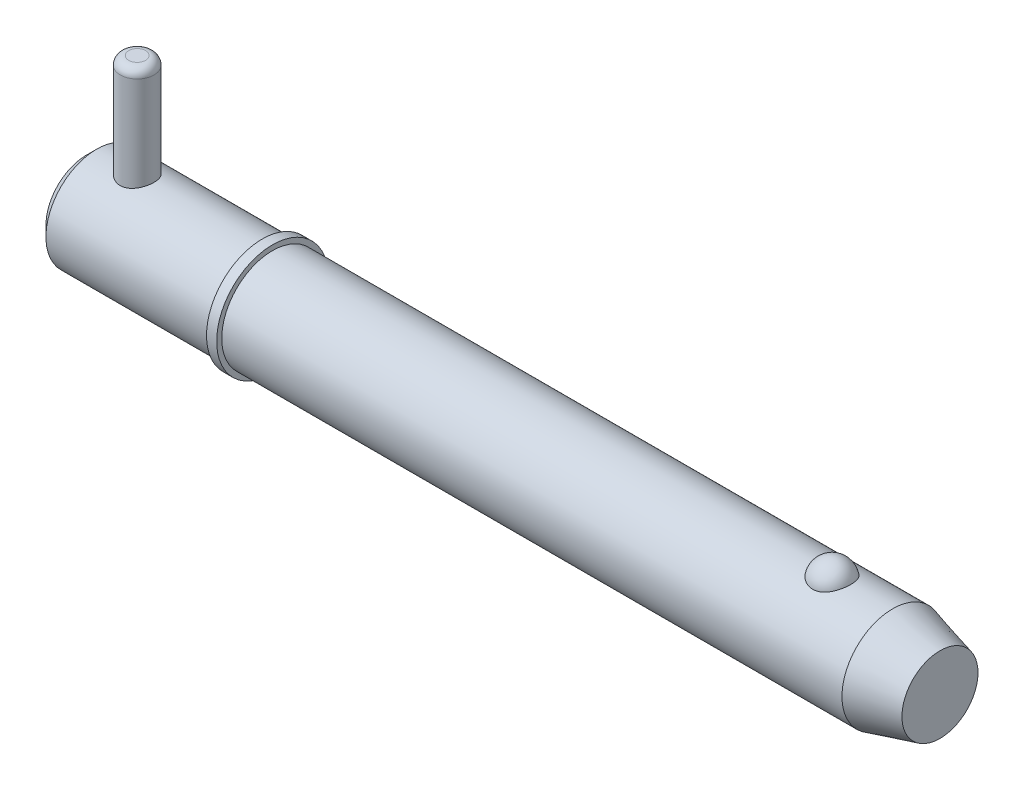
ISO-10303-21;
HEADER;
FILE_DESCRIPTION(('STEP AP214'),'2;1');
FILE_NAME('part.step','',(''),(''),'','','');
FILE_SCHEMA(('AUTOMOTIVE_DESIGN { 1 0 10303 214 1 1 1 1 }'));
ENDSEC;
DATA;
#1=APPLICATION_CONTEXT('core data for automotive mechanical design processes');
#2=APPLICATION_PROTOCOL_DEFINITION('international standard','automotive_design',2000,#1);
#3=PRODUCT_CONTEXT('',#1,'mechanical');
#4=PRODUCT('Part','Part','',(#3));
#5=PRODUCT_RELATED_PRODUCT_CATEGORY('part','',(#4));
#6=PRODUCT_DEFINITION_FORMATION('','',#4);
#7=PRODUCT_DEFINITION_CONTEXT('part definition',#1,'design');
#8=PRODUCT_DEFINITION('design','',#6,#7);
#9=PRODUCT_DEFINITION_SHAPE('','',#8);
#10=(LENGTH_UNIT() NAMED_UNIT(*) SI_UNIT(.MILLI.,.METRE.));
#11=(NAMED_UNIT(*) PLANE_ANGLE_UNIT() SI_UNIT($,.RADIAN.));
#12=(NAMED_UNIT(*) SI_UNIT($,.STERADIAN.) SOLID_ANGLE_UNIT());
#13=UNCERTAINTY_MEASURE_WITH_UNIT(LENGTH_MEASURE(1.E-05),#10,'distance_accuracy_value','');
#14=(GEOMETRIC_REPRESENTATION_CONTEXT(3) GLOBAL_UNCERTAINTY_ASSIGNED_CONTEXT((#13)) GLOBAL_UNIT_ASSIGNED_CONTEXT((#10,
#11,#12)) REPRESENTATION_CONTEXT('',''));
#15=CARTESIAN_POINT('',(0.,0.,0.));
#16=DIRECTION('',(0.,0.,1.));
#17=DIRECTION('',(1.,0.,0.));
#18=AXIS2_PLACEMENT_3D('',#15,#16,#17);
#19=CARTESIAN_POINT('',(9.525,28.575,0.));
#20=DIRECTION('',(0.,-1.,0.));
#21=DIRECTION('',(0.,0.,-1.));
#22=AXIS2_PLACEMENT_3D('',#19,#20,#21);
#23=CYLINDRICAL_SURFACE('',#22,3.175);
#24=CARTESIAN_POINT('',(9.525,-7.93750000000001,0.));
#25=DIRECTION('',(0.,1.,0.));
#26=DIRECTION('',(0.,0.,1.));
#27=AXIS2_PLACEMENT_3D('',#24,#25,#26);
#28=CIRCLE('',#27,3.175);
#29=CARTESIAN_POINT('',(9.525,-7.93750000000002,-3.175));
#30=VERTEX_POINT('',#29);
#31=EDGE_CURVE('P0_E25',#30,#30,#28,.T.);
#32=CARTESIAN_POINT('',(9.525,26.9875,0.));
#33=DIRECTION('',(0.,1.,0.));
#34=DIRECTION('',(0.,0.,1.));
#35=AXIS2_PLACEMENT_3D('',#32,#33,#34);
#36=CIRCLE('',#35,3.175);
#37=CARTESIAN_POINT('',(9.525,26.9875,-3.175));
#38=VERTEX_POINT('',#37);
#39=EDGE_CURVE('P0_E29',#38,#38,#36,.F.);
#40=CARTESIAN_POINT('',(9.525,-7.93750000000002,-3.175));
#41=CARTESIAN_POINT('',(9.525,-7.57369791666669,-3.175));
#42=CARTESIAN_POINT('',(9.525,-7.20989583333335,-3.175));
#43=CARTESIAN_POINT('',(9.525,-6.48229166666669,-3.175));
#44=CARTESIAN_POINT('',(9.525,-6.11848958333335,-3.175));
#45=CARTESIAN_POINT('',(9.525,-5.39088541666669,-3.175));
#46=CARTESIAN_POINT('',(9.525,-5.02708333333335,-3.175));
#47=CARTESIAN_POINT('',(9.525,-4.29947916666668,-3.175));
#48=CARTESIAN_POINT('',(9.525,-3.93567708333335,-3.175));
#49=CARTESIAN_POINT('',(9.525,-3.20807291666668,-3.175));
#50=CARTESIAN_POINT('',(9.525,-2.84427083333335,-3.175));
#51=CARTESIAN_POINT('',(9.525,-2.11666666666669,-3.175));
#52=CARTESIAN_POINT('',(9.525,-1.75286458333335,-3.175));
#53=CARTESIAN_POINT('',(9.525,-1.02526041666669,-3.175));
#54=CARTESIAN_POINT('',(9.525,-0.661458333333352,-3.175));
#55=CARTESIAN_POINT('',(9.525,0.0661458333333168,-3.175));
#56=CARTESIAN_POINT('',(9.525,0.429947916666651,-3.175));
#57=CARTESIAN_POINT('',(9.525,1.15755208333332,-3.175));
#58=CARTESIAN_POINT('',(9.525,1.52135416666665,-3.175));
#59=CARTESIAN_POINT('',(9.525,2.24895833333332,-3.175));
#60=CARTESIAN_POINT('',(9.525,2.61276041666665,-3.175));
#61=CARTESIAN_POINT('',(9.525,3.34036458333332,-3.175));
#62=CARTESIAN_POINT('',(9.525,3.70416666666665,-3.175));
#63=CARTESIAN_POINT('',(9.525,4.43177083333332,-3.175));
#64=CARTESIAN_POINT('',(9.525,4.79557291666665,-3.175));
#65=CARTESIAN_POINT('',(9.525,5.52317708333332,-3.175));
#66=CARTESIAN_POINT('',(9.525,5.88697916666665,-3.175));
#67=CARTESIAN_POINT('',(9.525,6.61458333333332,-3.175));
#68=CARTESIAN_POINT('',(9.525,6.97838541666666,-3.175));
#69=CARTESIAN_POINT('',(9.525,7.70598958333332,-3.175));
#70=CARTESIAN_POINT('',(9.525,8.06979166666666,-3.175));
#71=CARTESIAN_POINT('',(9.525,8.79739583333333,-3.175));
#72=CARTESIAN_POINT('',(9.525,9.16119791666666,-3.175));
#73=CARTESIAN_POINT('',(9.525,9.88880208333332,-3.175));
#74=CARTESIAN_POINT('',(9.525,10.2526041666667,-3.175));
#75=CARTESIAN_POINT('',(9.525,10.9802083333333,-3.175));
#76=CARTESIAN_POINT('',(9.525,11.3440104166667,-3.175));
#77=CARTESIAN_POINT('',(9.525,12.0716145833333,-3.175));
#78=CARTESIAN_POINT('',(9.525,12.4354166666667,-3.175));
#79=CARTESIAN_POINT('',(9.525,13.1630208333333,-3.175));
#80=CARTESIAN_POINT('',(9.525,13.5268229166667,-3.175));
#81=CARTESIAN_POINT('',(9.525,14.2544270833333,-3.175));
#82=CARTESIAN_POINT('',(9.525,14.6182291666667,-3.175));
#83=CARTESIAN_POINT('',(9.525,15.3458333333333,-3.175));
#84=CARTESIAN_POINT('',(9.525,15.7096354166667,-3.175));
#85=CARTESIAN_POINT('',(9.525,16.4372395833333,-3.175));
#86=CARTESIAN_POINT('',(9.525,16.8010416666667,-3.175));
#87=CARTESIAN_POINT('',(9.525,17.5286458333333,-3.175));
#88=CARTESIAN_POINT('',(9.525,17.8924479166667,-3.175));
#89=CARTESIAN_POINT('',(9.525,18.6200520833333,-3.175));
#90=CARTESIAN_POINT('',(9.525,18.9838541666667,-3.175));
#91=CARTESIAN_POINT('',(9.525,19.7114583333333,-3.175));
#92=CARTESIAN_POINT('',(9.525,20.0752604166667,-3.175));
#93=CARTESIAN_POINT('',(9.525,20.8028645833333,-3.175));
#94=CARTESIAN_POINT('',(9.525,21.1666666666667,-3.175));
#95=CARTESIAN_POINT('',(9.525,21.8942708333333,-3.175));
#96=CARTESIAN_POINT('',(9.525,22.2580729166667,-3.175));
#97=CARTESIAN_POINT('',(9.525,22.9856770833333,-3.175));
#98=CARTESIAN_POINT('',(9.525,23.3494791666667,-3.175));
#99=CARTESIAN_POINT('',(9.525,24.0770833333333,-3.175));
#100=CARTESIAN_POINT('',(9.525,24.4408854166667,-3.175));
#101=CARTESIAN_POINT('',(9.525,25.1684895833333,-3.175));
#102=CARTESIAN_POINT('',(9.525,25.5322916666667,-3.175));
#103=CARTESIAN_POINT('',(9.525,26.2598958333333,-3.175));
#104=CARTESIAN_POINT('',(9.525,26.6236979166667,-3.175));
#105=CARTESIAN_POINT('',(9.525,26.9875,-3.175));
#106=B_SPLINE_CURVE_WITH_KNOTS('',3,(#40,#41,#42,#43,#44,#45,#46,#47,#48,#49,#50,#51,#52,#53,
#54,#55,#56,#57,#58,#59,#60,#61,#62,#63,#64,#65,#66,#67,#68,#69,#70,#71,#72,#73,#74,#75,#76,#77,
#78,#79,#80,#81,#82,#83,#84,#85,#86,#87,#88,#89,#90,#91,#92,#93,#94,#95,#96,#97,#98,#99,#100,
#101,#102,#103,#104,#105),.UNSPECIFIED.,.F.,.F.,(4,2,2,2,2,2,2,2,2,2,2,2,2,2,2,2,2,2,2,2,2,2,2,
2,2,2,2,2,2,2,2,2,4),(0.,1.09140625,2.1828125,3.27421875,4.365625,5.45703125,6.5484375,
7.63984375,8.73125000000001,9.82265625,10.9140625,12.00546875,13.096875,14.18828125,15.2796875,
16.37109375,17.4625,18.55390625,19.6453125,20.73671875,21.828125,22.91953125,24.0109375,
25.10234375,26.19375,27.28515625,28.3765625,29.46796875,30.559375,31.65078125,32.7421875,
33.83359375,34.925),.UNSPECIFIED.);
#107=EDGE_CURVE('P0_BSEAM14',#30,#38,#106,.T.);
#108=ORIENTED_EDGE('',*,*,#31,.T.);
#109=ORIENTED_EDGE('',*,*,#39,.T.);
#110=ORIENTED_EDGE('',*,*,#107,.T.);
#111=ORIENTED_EDGE('',*,*,#107,.F.);
#112=EDGE_LOOP('',(#108,#110,#109,#111));
#113=FACE_BOUND('',#112,.T.);
#114=ADVANCED_FACE('P0_F14',(#113),#23,.T.);
#115=CARTESIAN_POINT('',(9.525,28.575,0.));
#116=DIRECTION('',(0.,1.,0.));
#117=DIRECTION('',(0.,0.,1.));
#118=AXIS2_PLACEMENT_3D('',#115,#116,#117);
#119=PLANE('',#118);
#120=CARTESIAN_POINT('',(9.525,28.575,0.));
#121=DIRECTION('',(0.,1.,0.));
#122=DIRECTION('',(0.,0.,1.));
#123=AXIS2_PLACEMENT_3D('',#120,#121,#122);
#124=CIRCLE('',#123,1.5875);
#125=CARTESIAN_POINT('',(9.525,28.575,1.5875));
#126=VERTEX_POINT('',#125);
#127=EDGE_CURVE('P0_E10',#126,#126,#124,.T.);
#128=ORIENTED_EDGE('',*,*,#127,.T.);
#129=EDGE_LOOP('',(#128));
#130=FACE_BOUND('',#129,.T.);
#131=ADVANCED_FACE('P0_F46',(#130),#119,.T.);
#132=CARTESIAN_POINT('',(9.525,-9.525,0.));
#133=DIRECTION('',(0.,1.,0.));
#134=DIRECTION('',(0.,0.,1.));
#135=AXIS2_PLACEMENT_3D('',#132,#133,#134);
#136=PLANE('',#135);
#137=CARTESIAN_POINT('',(9.525,-9.525,0.));
#138=DIRECTION('',(0.,1.,0.));
#139=DIRECTION('',(0.,0.,1.));
#140=AXIS2_PLACEMENT_3D('',#137,#138,#139);
#141=CIRCLE('',#140,1.5875);
#142=CARTESIAN_POINT('',(9.525,-9.525,1.5875));
#143=VERTEX_POINT('',#142);
#144=EDGE_CURVE('P0_E21',#143,#143,#141,.F.);
#145=ORIENTED_EDGE('',*,*,#144,.T.);
#146=EDGE_LOOP('',(#145));
#147=FACE_BOUND('',#146,.T.);
#148=ADVANCED_FACE('P0_F43',(#147),#136,.F.);
#149=CARTESIAN_POINT('',(9.525,-7.9375,0.));
#150=DIRECTION('',(0.,1.,0.));
#151=DIRECTION('',(0.,0.,1.));
#152=AXIS2_PLACEMENT_3D('',#149,#150,#151);
#153=DEGENERATE_TOROIDAL_SURFACE('',#152,1.5875,1.5875,.T.);
#154=ORIENTED_EDGE('',*,*,#144,.F.);
#155=EDGE_LOOP('',(#154));
#156=FACE_BOUND('',#155,.T.);
#157=ORIENTED_EDGE('',*,*,#31,.F.);
#158=EDGE_LOOP('',(#157));
#159=FACE_BOUND('',#158,.T.);
#160=ADVANCED_FACE('P0_F38',(#156,#159),#153,.T.);
#161=CARTESIAN_POINT('',(9.525,26.9875,0.));
#162=DIRECTION('',(0.,1.,0.));
#163=DIRECTION('',(0.,0.,1.));
#164=AXIS2_PLACEMENT_3D('',#161,#162,#163);
#165=DEGENERATE_TOROIDAL_SURFACE('',#164,1.5875,1.5875,.T.);
#166=ORIENTED_EDGE('',*,*,#39,.F.);
#167=EDGE_LOOP('',(#166));
#168=FACE_BOUND('',#167,.T.);
#169=ORIENTED_EDGE('',*,*,#127,.F.);
#170=EDGE_LOOP('',(#169));
#171=FACE_BOUND('',#170,.T.);
#172=ADVANCED_FACE('P0_F16',(#168,#171),#165,.T.);
#173=CLOSED_SHELL('',(#114,#131,#148,#160,#172));
#174=MANIFOLD_SOLID_BREP('P0_B1',#173);
#175=CARTESIAN_POINT('',(0.,0.,0.));
#176=DIRECTION('',(1.,0.,0.));
#177=DIRECTION('',(0.,0.,-1.));
#178=AXIS2_PLACEMENT_3D('',#175,#176,#177);
#179=CYLINDRICAL_SURFACE('',#178,9.525);
#180=CARTESIAN_POINT('',(151.443054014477,0.,0.));
#181=DIRECTION('',(1.,0.,0.));
#182=DIRECTION('',(0.,0.,-1.));
#183=AXIS2_PLACEMENT_3D('',#180,#181,#182);
#184=CIRCLE('',#183,9.525);
#185=CARTESIAN_POINT('',(151.443054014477,0.,-9.525));
#186=VERTEX_POINT('',#185);
#187=EDGE_CURVE('P1_E81',#186,#186,#184,.T.);
#188=ORIENTED_EDGE('',*,*,#187,.F.);
#189=EDGE_LOOP('',(#188));
#190=FACE_BOUND('',#189,.T.);
#191=CARTESIAN_POINT('',(34.93,0.,0.));
#192=DIRECTION('',(1.,0.,0.));
#193=DIRECTION('',(0.,0.,-1.));
#194=AXIS2_PLACEMENT_3D('',#191,#192,#193);
#195=CIRCLE('',#194,9.525);
#196=CARTESIAN_POINT('',(34.93,0.,-9.525));
#197=VERTEX_POINT('',#196);
#198=EDGE_CURVE('P1_E85',#197,#197,#195,.T.);
#199=ORIENTED_EDGE('',*,*,#198,.T.);
#200=EDGE_LOOP('',(#199));
#201=FACE_BOUND('',#200,.T.);
#202=CARTESIAN_POINT('',(140.045757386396,8.80405803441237,3.63513233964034));
#203=CARTESIAN_POINT('',(139.951676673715,8.80405953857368,3.63513053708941));
#204=CARTESIAN_POINT('',(139.857561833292,8.80561325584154,3.63137461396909));
#205=CARTESIAN_POINT('',(139.670012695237,8.81177748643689,3.61638665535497));
#206=CARTESIAN_POINT('',(139.576578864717,8.81638992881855,3.60514990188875));
#207=CARTESIAN_POINT('',(139.297945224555,8.83467114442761,3.56024627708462));
#208=CARTESIAN_POINT('',(139.114691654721,8.85278327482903,3.51538626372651));
#209=CARTESIAN_POINT('',(138.759509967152,8.89871214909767,3.39742145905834));
#210=CARTESIAN_POINT('',(138.587553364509,8.92650327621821,3.32439116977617));
#211=CARTESIAN_POINT('',(138.258707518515,8.98874819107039,3.15220244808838));
#212=CARTESIAN_POINT('',(138.101811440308,9.02319893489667,3.05305594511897));
#213=CARTESIAN_POINT('',(137.802214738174,9.09629186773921,2.82797815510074));
#214=CARTESIAN_POINT('',(137.660060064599,9.13502685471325,2.70135138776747));
#215=CARTESIAN_POINT('',(137.398299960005,9.21186572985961,2.42641932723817));
#216=CARTESIAN_POINT('',(137.278701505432,9.24996941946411,2.2781073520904));
#217=CARTESIAN_POINT('',(137.059645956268,9.32341082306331,1.95652290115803));
#218=CARTESIAN_POINT('',(136.961317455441,9.35855090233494,1.78243511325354));
#219=CARTESIAN_POINT('',(136.793819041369,9.42045142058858,1.41937246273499));
#220=CARTESIAN_POINT('',(136.724651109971,9.44721128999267,1.23039658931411));
#221=CARTESIAN_POINT('',(136.616199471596,9.48990641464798,0.84037088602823));
#222=CARTESIAN_POINT('',(136.577288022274,9.50570658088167,0.639202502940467));
#223=CARTESIAN_POINT('',(136.531555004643,9.52433146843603,0.232664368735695));
#224=CARTESIAN_POINT('',(136.524732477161,9.52715657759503,0.0272947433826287));
#225=CARTESIAN_POINT('',(136.543255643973,9.51956918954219,-0.380478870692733));
#226=CARTESIAN_POINT('',(136.568405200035,9.50923740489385,-0.582893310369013));
#227=CARTESIAN_POINT('',(136.65002537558,9.47651897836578,-0.98029399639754));
#228=CARTESIAN_POINT('',(136.706496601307,9.45413210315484,-1.17528009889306));
#229=CARTESIAN_POINT('',(136.849719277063,9.39954044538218,-1.55263697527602));
#230=CARTESIAN_POINT('',(136.936512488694,9.36732213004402,-1.73498993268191));
#231=CARTESIAN_POINT('',(137.138610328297,9.29640700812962,-2.08177763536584));
#232=CARTESIAN_POINT('',(137.253917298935,9.25770966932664,-2.24621090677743));
#233=CARTESIAN_POINT('',(137.511264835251,9.17775604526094,-2.5533833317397));
#234=CARTESIAN_POINT('',(137.653434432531,9.136488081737,-2.696011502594));
#235=CARTESIAN_POINT('',(137.96089985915,9.05620497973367,-2.95451229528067));
#236=CARTESIAN_POINT('',(138.126193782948,9.01718965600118,-3.07038711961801));
#237=CARTESIAN_POINT('',(138.472052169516,8.94680019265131,-3.26976836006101));
#238=CARTESIAN_POINT('',(138.652227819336,8.91528408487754,-3.35389750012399));
#239=CARTESIAN_POINT('',(139.025651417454,8.86272514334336,-3.49043503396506));
#240=CARTESIAN_POINT('',(139.218894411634,8.84167836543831,-3.54285537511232));
#241=CARTESIAN_POINT('',(139.602503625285,8.81348056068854,-3.61241306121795));
#242=CARTESIAN_POINT('',(139.792525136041,8.80568348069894,-3.6311933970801));
#243=CARTESIAN_POINT('',(140.173190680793,8.80289410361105,-3.63795342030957));
#244=CARTESIAN_POINT('',(140.363834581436,8.80789922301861,-3.62593932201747));
#245=CARTESIAN_POINT('',(140.734007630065,8.82974915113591,-3.57238430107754));
#246=CARTESIAN_POINT('',(140.913697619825,8.84621463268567,-3.53178890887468));
#247=CARTESIAN_POINT('',(141.263422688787,8.88875330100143,-3.42331083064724));
#248=CARTESIAN_POINT('',(141.433456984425,8.91482726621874,-3.35542593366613));
#249=CARTESIAN_POINT('',(141.763237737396,8.97448239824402,-3.19248225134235));
#250=CARTESIAN_POINT('',(141.922680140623,9.00821446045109,-3.0968647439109));
#251=CARTESIAN_POINT('',(142.223513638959,9.07935398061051,-2.88162736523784));
#252=CARTESIAN_POINT('',(142.364900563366,9.11676228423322,-2.76200196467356));
#253=CARTESIAN_POINT('',(142.63331931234,9.19347419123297,-2.49516285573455));
#254=CARTESIAN_POINT('',(142.759275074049,9.23277872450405,-2.34686614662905));
#255=CARTESIAN_POINT('',(142.985522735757,9.3073761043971,-2.03093683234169));
#256=CARTESIAN_POINT('',(143.08581004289,9.34266823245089,-1.86330077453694));
#257=CARTESIAN_POINT('',(143.261514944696,9.40674710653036,-1.50744893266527));
#258=CARTESIAN_POINT('',(143.336041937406,9.43529176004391,-1.31874876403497));
#259=CARTESIAN_POINT('',(143.45416505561,9.48144132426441,-0.930631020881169));
#260=CARTESIAN_POINT('',(143.497760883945,9.49904612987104,-0.731213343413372));
#261=CARTESIAN_POINT('',(143.553158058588,9.5215314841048,-0.327147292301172));
#262=CARTESIAN_POINT('',(143.564935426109,9.52640243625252,-0.122495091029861));
#263=CARTESIAN_POINT('',(143.556382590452,9.5228957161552,0.28601848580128));
#264=CARTESIAN_POINT('',(143.53605305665,9.5145183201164,0.489879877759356));
#265=CARTESIAN_POINT('',(143.463884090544,9.48544083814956,0.88999431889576));
#266=CARTESIAN_POINT('',(143.412199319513,9.46480124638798,1.08627971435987));
#267=CARTESIAN_POINT('',(143.278491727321,9.4133389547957,1.46682086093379));
#268=CARTESIAN_POINT('',(143.196466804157,9.38251554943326,1.65107577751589));
#269=CARTESIAN_POINT('',(143.00319292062,9.31365636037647,2.00346348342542));
#270=CARTESIAN_POINT('',(142.891783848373,9.27558138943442,2.17150083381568));
#271=CARTESIAN_POINT('',(142.642294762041,9.19638714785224,2.48563115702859));
#272=CARTESIAN_POINT('',(142.504216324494,9.15526805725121,2.63172542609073));
#273=CARTESIAN_POINT('',(142.204843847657,9.07465393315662,2.89750997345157));
#274=CARTESIAN_POINT('',(142.043610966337,9.03515496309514,3.01726776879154));
#275=CARTESIAN_POINT('',(141.701613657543,8.96227564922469,3.22732920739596));
#276=CARTESIAN_POINT('',(141.520841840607,8.92889763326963,3.31762165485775));
#277=CARTESIAN_POINT('',(141.151445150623,8.8734538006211,3.46314419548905));
#278=CARTESIAN_POINT('',(140.96332371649,8.85102983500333,3.51950082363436));
#279=CARTESIAN_POINT('',(140.67578699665,8.8266696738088,3.57993683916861));
#280=CARTESIAN_POINT('',(140.579133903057,8.82009725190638,3.5960621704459));
#281=CARTESIAN_POINT('',(140.384677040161,8.81020897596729,3.62022512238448));
#282=CARTESIAN_POINT('',(140.286874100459,8.80689090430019,3.62826825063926));
#283=CARTESIAN_POINT('',(140.141224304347,8.80445615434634,3.63416760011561));
#284=CARTESIAN_POINT('',(140.093495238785,8.80405727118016,3.63513325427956));
#285=CARTESIAN_POINT('',(140.045757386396,8.80405803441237,3.63513233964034));
#286=B_SPLINE_CURVE_WITH_KNOTS('',3,(#202,#203,#204,#205,#206,#207,#208,#209,#210,#211,#212,
#213,#214,#215,#216,#217,#218,#219,#220,#221,#222,#223,#224,#225,#226,#227,#228,#229,#230,#231,
#232,#233,#234,#235,#236,#237,#238,#239,#240,#241,#242,#243,#244,#245,#246,#247,#248,#249,#250,
#251,#252,#253,#254,#255,#256,#257,#258,#259,#260,#261,#262,#263,#264,#265,#266,#267,#268,#269,
#270,#271,#272,#273,#274,#275,#276,#277,#278,#279,#280,#281,#282,#283,#284,#285),.UNSPECIFIED.,
.T.,.F.,(4,2,2,2,2,2,2,2,2,2,2,2,2,2,2,2,2,2,2,2,2,2,2,2,2,2,2,2,2,2,2,2,2,2,2,2,2,2,2,2,2,4),
(0.,0.282202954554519,0.564584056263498,1.13017050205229,1.69427128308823,2.25811483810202,
2.83836627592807,3.41879688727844,4.02497117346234,4.63118665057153,5.24474754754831,
5.85829010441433,6.46808687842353,7.07789545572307,7.68854723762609,8.299249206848,
8.91296283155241,9.52662591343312,10.1275338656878,10.7282152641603,11.2986646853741,
11.8689989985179,12.4213015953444,12.973648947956,13.5380053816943,14.1024919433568,
14.695298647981,15.2882113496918,15.8999469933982,16.5116885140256,17.1238909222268,
17.7360805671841,18.3452748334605,18.9545113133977,19.567138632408,20.179729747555,
20.7907316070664,21.4019653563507,21.9915938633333,22.2859053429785,22.5800161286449,
22.7232098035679),.UNSPECIFIED.);
#287=CARTESIAN_POINT('',(140.045757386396,8.80405803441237,3.63513233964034));
#288=VERTEX_POINT('',#287);
#289=EDGE_CURVE('P1_E35',#288,#288,#286,.T.);
#290=ORIENTED_EDGE('',*,*,#289,.T.);
#291=EDGE_LOOP('',(#290));
#292=FACE_BOUND('',#291,.T.);
#293=ADVANCED_FACE('P1_F13',(#190,#201,#292),#179,.T.);
#294=CARTESIAN_POINT('',(0.,0.,0.));
#295=DIRECTION('',(-1.,0.,0.));
#296=DIRECTION('',(0.,0.,1.));
#297=AXIS2_PLACEMENT_3D('',#294,#295,#296);
#298=PLANE('',#297);
#299=CARTESIAN_POINT('',(0.,0.,0.));
#300=DIRECTION('',(1.,0.,0.));
#301=DIRECTION('',(0.,0.,-1.));
#302=AXIS2_PLACEMENT_3D('',#299,#300,#301);
#303=CIRCLE('',#302,7.62);
#304=CARTESIAN_POINT('',(0.,0.,-7.62));
#305=VERTEX_POINT('',#304);
#306=EDGE_CURVE('P1_E9',#305,#305,#303,.T.);
#307=ORIENTED_EDGE('',*,*,#306,.F.);
#308=EDGE_LOOP('',(#307));
#309=FACE_BOUND('',#308,.T.);
#310=ADVANCED_FACE('P1_F15',(#309),#298,.T.);
#311=CARTESIAN_POINT('',(1.90499999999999,0.,0.));
#312=DIRECTION('',(1.,0.,0.));
#313=DIRECTION('',(0.,0.,-1.));
#314=AXIS2_PLACEMENT_3D('',#311,#312,#313);
#315=CONICAL_SURFACE('',#314,9.525,0.785398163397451);
#316=ORIENTED_EDGE('',*,*,#306,.T.);
#317=EDGE_LOOP('',(#316));
#318=FACE_BOUND('',#317,.T.);
#319=CARTESIAN_POINT('',(1.90499999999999,0.,0.));
#320=DIRECTION('',(1.,0.,0.));
#321=DIRECTION('',(0.,0.,-1.));
#322=AXIS2_PLACEMENT_3D('',#319,#320,#321);
#323=CIRCLE('',#322,9.525);
#324=CARTESIAN_POINT('',(1.90499999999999,0.,-9.525));
#325=VERTEX_POINT('',#324);
#326=EDGE_CURVE('P1_E26',#325,#325,#323,.T.);
#327=ORIENTED_EDGE('',*,*,#326,.F.);
#328=EDGE_LOOP('',(#327));
#329=FACE_BOUND('',#328,.T.);
#330=ADVANCED_FACE('P1_F77',(#318,#329),#315,.T.);
#331=CARTESIAN_POINT('',(0.,0.,0.));
#332=DIRECTION('',(1.,0.,0.));
#333=DIRECTION('',(0.,0.,-1.));
#334=AXIS2_PLACEMENT_3D('',#331,#332,#333);
#335=CYLINDRICAL_SURFACE('',#334,9.525);
#336=CARTESIAN_POINT('',(9.525,-8.98025612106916,3.175));
#337=CARTESIAN_POINT('',(9.35206354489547,-8.98025555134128,3.17500081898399));
#338=CARTESIAN_POINT('',(9.17913201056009,-8.98530617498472,3.16082293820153));
#339=CARTESIAN_POINT('',(8.83839221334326,-9.00485797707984,3.10467734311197));
#340=CARTESIAN_POINT('',(8.67058479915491,-9.0193607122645,3.06270505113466));
#341=CARTESIAN_POINT('',(8.34508461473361,-9.05599546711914,2.95260866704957));
#342=CARTESIAN_POINT('',(8.18737272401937,-9.07811252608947,2.88453582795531));
#343=CARTESIAN_POINT('',(7.88555684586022,-9.12746212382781,2.72434567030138));
#344=CARTESIAN_POINT('',(7.74145587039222,-9.1546957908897,2.63222304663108));
#345=CARTESIAN_POINT('',(7.46531411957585,-9.21240503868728,2.42268738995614));
#346=CARTESIAN_POINT('',(7.33388351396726,-9.24296141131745,2.30449228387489));
#347=CARTESIAN_POINT('',(7.09229340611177,-9.30319020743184,2.0478358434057));
#348=CARTESIAN_POINT('',(6.98213731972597,-9.33286248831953,1.90937126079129));
#349=CARTESIAN_POINT('',(6.78345450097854,-9.38891527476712,1.61164431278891));
#350=CARTESIAN_POINT('',(6.69556709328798,-9.41518969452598,1.45193356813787));
#351=CARTESIAN_POINT('',(6.54814671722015,-9.46053437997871,1.11896913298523));
#352=CARTESIAN_POINT('',(6.48860610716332,-9.47960658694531,0.945719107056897));
#353=CARTESIAN_POINT('',(6.40163866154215,-9.50782564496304,0.596991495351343));
#354=CARTESIAN_POINT('',(6.373166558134,-9.5172947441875,0.421801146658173));
#355=CARTESIAN_POINT('',(6.3458207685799,-9.52638456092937,0.068890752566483));
#356=CARTESIAN_POINT('',(6.34693945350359,-9.52600781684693,-0.108828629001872));
#357=CARTESIAN_POINT('',(6.37808050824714,-9.51566675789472,-0.454353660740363));
#358=CARTESIAN_POINT('',(6.4069675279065,-9.50607905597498,-0.622274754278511));
#359=CARTESIAN_POINT('',(6.490947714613,-9.47886621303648,-0.950732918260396));
#360=CARTESIAN_POINT('',(6.54604265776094,-9.46124052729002,-1.11126948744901));
#361=CARTESIAN_POINT('',(6.68153768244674,-9.41945253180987,-1.42288410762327));
#362=CARTESIAN_POINT('',(6.76226085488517,-9.3952073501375,-1.57381010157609));
#363=CARTESIAN_POINT('',(6.94645456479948,-9.34270397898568,-1.86030973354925));
#364=CARTESIAN_POINT('',(7.04993142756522,-9.31444467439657,-1.99587908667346));
#365=CARTESIAN_POINT('',(7.28241619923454,-9.25532159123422,-2.2545702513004));
#366=CARTESIAN_POINT('',(7.4123967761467,-9.22439783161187,-2.37680549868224));
#367=CARTESIAN_POINT('',(7.69127470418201,-9.1645528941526,-2.5980302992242));
#368=CARTESIAN_POINT('',(7.84017496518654,-9.13563202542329,-2.6970162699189));
#369=CARTESIAN_POINT('',(8.15547526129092,-9.08273917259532,-2.87016016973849));
#370=CARTESIAN_POINT('',(8.32209451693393,-9.05884361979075,-2.94394402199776));
#371=CARTESIAN_POINT('',(8.66638917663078,-9.01959241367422,-3.06210713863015));
#372=CARTESIAN_POINT('',(8.84405991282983,-9.00423318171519,-3.10649872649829));
#373=CARTESIAN_POINT('',(9.19682677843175,-8.98460345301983,-3.16281207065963));
#374=CARTESIAN_POINT('',(9.37167742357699,-8.9798639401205,-3.17610837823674));
#375=CARTESIAN_POINT('',(9.72113927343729,-8.9806993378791,-3.17374726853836));
#376=CARTESIAN_POINT('',(9.89575051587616,-8.98627237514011,-3.15809511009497));
#377=CARTESIAN_POINT('',(10.2335233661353,-9.00663737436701,-3.09951644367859));
#378=CARTESIAN_POINT('',(10.3968722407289,-9.02110608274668,-3.05754530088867));
#379=CARTESIAN_POINT('',(10.7141759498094,-9.05727657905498,-2.94866651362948));
#380=CARTESIAN_POINT('',(10.8681291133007,-9.07897964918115,-2.88175444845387));
#381=CARTESIAN_POINT('',(11.1676828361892,-9.12802586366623,-2.72248103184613));
#382=CARTESIAN_POINT('',(11.3128635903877,-9.1555260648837,-2.62937980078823));
#383=CARTESIAN_POINT('',(11.5860387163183,-9.21276315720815,-2.42120937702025));
#384=CARTESIAN_POINT('',(11.7140280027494,-9.24250070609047,-2.30613370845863));
#385=CARTESIAN_POINT('',(11.9555513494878,-9.30259247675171,-2.05070616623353));
#386=CARTESIAN_POINT('',(12.0680936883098,-9.33290753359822,-1.90940458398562));
#387=CARTESIAN_POINT('',(12.267933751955,-9.3893275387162,-1.60917665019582));
#388=CARTESIAN_POINT('',(12.3552323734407,-9.41543263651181,-1.45025092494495));
#389=CARTESIAN_POINT('',(12.5013088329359,-9.46036988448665,-1.12007606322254));
#390=CARTESIAN_POINT('',(12.5602723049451,-9.47924920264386,-0.9489158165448));
#391=CARTESIAN_POINT('',(12.6483355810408,-9.50781089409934,-0.598355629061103));
#392=CARTESIAN_POINT('',(12.6774461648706,-9.5174965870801,-0.4189586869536));
#393=CARTESIAN_POINT('',(12.7040070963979,-9.52632915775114,-0.066088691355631));
#394=CARTESIAN_POINT('',(12.7028811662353,-9.52594996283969,0.107266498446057));
#395=CARTESIAN_POINT('',(12.6725130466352,-9.51586223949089,0.451202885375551));
#396=CARTESIAN_POINT('',(12.643273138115,-9.50615446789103,0.621784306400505));
#397=CARTESIAN_POINT('',(12.5584514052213,-9.47867404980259,0.952633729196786));
#398=CARTESIAN_POINT('',(12.5032953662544,-9.46103195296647,1.1130225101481));
#399=CARTESIAN_POINT('',(12.3686013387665,-9.41949985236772,1.42233126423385));
#400=CARTESIAN_POINT('',(12.2890589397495,-9.39560871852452,1.57124915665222));
#401=CARTESIAN_POINT('',(12.1044667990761,-9.34294133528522,1.85938800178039));
#402=CARTESIAN_POINT('',(11.9985831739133,-9.31401720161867,1.9980473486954));
#403=CARTESIAN_POINT('',(11.7657327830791,-9.25490239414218,2.25609475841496));
#404=CARTESIAN_POINT('',(11.6387592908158,-9.22471131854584,2.37547664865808));
#405=CARTESIAN_POINT('',(11.3613902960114,-9.16505913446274,2.59633024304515));
#406=CARTESIAN_POINT('',(11.2102725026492,-9.13567286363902,2.69691791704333));
#407=CARTESIAN_POINT('',(10.8923631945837,-9.08241113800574,2.87119803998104));
#408=CARTESIAN_POINT('',(10.7255757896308,-9.05853424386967,2.94489751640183));
#409=CARTESIAN_POINT('',(10.3887212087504,-9.02021736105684,3.06020415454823));
#410=CARTESIAN_POINT('',(10.219143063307,-9.00539959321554,3.10311136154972));
#411=CARTESIAN_POINT('',(9.87470703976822,-8.98542092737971,3.16050396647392));
#412=CARTESIAN_POINT('',(9.699851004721,-8.98025669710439,3.17499917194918));
#413=CARTESIAN_POINT('',(9.525,-8.98025612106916,3.175));
#414=B_SPLINE_CURVE_WITH_KNOTS('',3,(#336,#337,#338,#339,#340,#341,#342,#343,#344,#345,#346,
#347,#348,#349,#350,#351,#352,#353,#354,#355,#356,#357,#358,#359,#360,#361,#362,#363,#364,#365,
#366,#367,#368,#369,#370,#371,#372,#373,#374,#375,#376,#377,#378,#379,#380,#381,#382,#383,#384,
#385,#386,#387,#388,#389,#390,#391,#392,#393,#394,#395,#396,#397,#398,#399,#400,#401,#402,#403,
#404,#405,#406,#407,#408,#409,#410,#411,#412,#413),.UNSPECIFIED.,.T.,.F.,(4,2,2,2,2,2,2,2,2,2,2,
2,2,2,2,2,2,2,2,2,2,2,2,2,2,2,2,2,2,2,2,2,2,2,2,2,2,2,4),(0.,0.518161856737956,1.03640907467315,
1.55364379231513,2.07099270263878,2.60671746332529,3.14252816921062,3.69231882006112,
4.24196117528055,4.77247962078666,5.30286129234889,5.81244090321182,6.32205505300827,
6.83836754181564,7.3548237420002,7.89559553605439,8.43645060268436,8.98501631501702,
9.53335188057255,10.056948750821,10.5804505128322,11.0859695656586,11.5915782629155,
12.1132237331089,12.6350231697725,13.1819271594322,13.7288117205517,14.2720628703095,
14.815117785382,15.3326491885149,15.8501386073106,16.3594083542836,16.868770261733,
17.3969527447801,17.925304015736,18.4743376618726,19.023227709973,19.5473069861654,
20.0712053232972),.UNSPECIFIED.);
#415=CARTESIAN_POINT('',(9.525,-8.98025612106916,3.175));
#416=VERTEX_POINT('',#415);
#417=EDGE_CURVE('P1_E17',#416,#416,#414,.T.);
#418=ORIENTED_EDGE('',*,*,#417,.F.);
#419=EDGE_LOOP('',(#418));
#420=FACE_BOUND('',#419,.T.);
#421=CARTESIAN_POINT('',(9.525,8.98025612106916,3.175));
#422=CARTESIAN_POINT('',(9.69793645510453,8.98025555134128,3.17500081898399));
#423=CARTESIAN_POINT('',(9.87086798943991,8.98530617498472,3.16082293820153));
#424=CARTESIAN_POINT('',(10.2116077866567,9.00485797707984,3.10467734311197));
#425=CARTESIAN_POINT('',(10.3794152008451,9.0193607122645,3.06270505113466));
#426=CARTESIAN_POINT('',(10.7049153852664,9.05599546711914,2.95260866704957));
#427=CARTESIAN_POINT('',(10.8626272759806,9.07811252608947,2.88453582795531));
#428=CARTESIAN_POINT('',(11.1644431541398,9.12746212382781,2.72434567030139));
#429=CARTESIAN_POINT('',(11.3085441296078,9.15469579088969,2.63222304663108));
#430=CARTESIAN_POINT('',(11.5846858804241,9.21240503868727,2.42268738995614));
#431=CARTESIAN_POINT('',(11.7161164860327,9.24296141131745,2.30449228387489));
#432=CARTESIAN_POINT('',(11.9577065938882,9.30319020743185,2.0478358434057));
#433=CARTESIAN_POINT('',(12.067862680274,9.33286248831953,1.90937126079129));
#434=CARTESIAN_POINT('',(12.2665454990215,9.38891527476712,1.61164431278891));
#435=CARTESIAN_POINT('',(12.354432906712,9.41518969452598,1.45193356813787));
#436=CARTESIAN_POINT('',(12.5018532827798,9.46053437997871,1.11896913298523));
#437=CARTESIAN_POINT('',(12.5613938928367,9.47960658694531,0.945719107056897));
#438=CARTESIAN_POINT('',(12.6483613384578,9.50782564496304,0.596991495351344));
#439=CARTESIAN_POINT('',(12.676833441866,9.5172947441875,0.421801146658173));
#440=CARTESIAN_POINT('',(12.7041792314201,9.52638456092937,0.0688907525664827));
#441=CARTESIAN_POINT('',(12.7030605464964,9.52600781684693,-0.108828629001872));
#442=CARTESIAN_POINT('',(12.6719194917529,9.51566675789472,-0.454353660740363));
#443=CARTESIAN_POINT('',(12.6430324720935,9.50607905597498,-0.622274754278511));
#444=CARTESIAN_POINT('',(12.559052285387,9.47886621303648,-0.950732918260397));
#445=CARTESIAN_POINT('',(12.5039573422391,9.46124052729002,-1.11126948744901));
#446=CARTESIAN_POINT('',(12.3684623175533,9.41945253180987,-1.42288410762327));
#447=CARTESIAN_POINT('',(12.2877391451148,9.3952073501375,-1.57381010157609));
#448=CARTESIAN_POINT('',(12.1035454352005,9.34270397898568,-1.86030973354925));
#449=CARTESIAN_POINT('',(12.0000685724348,9.31444467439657,-1.99587908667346));
#450=CARTESIAN_POINT('',(11.7675838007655,9.25532159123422,-2.2545702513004));
#451=CARTESIAN_POINT('',(11.6376032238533,9.22439783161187,-2.37680549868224));
#452=CARTESIAN_POINT('',(11.358725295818,9.1645528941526,-2.5980302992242));
#453=CARTESIAN_POINT('',(11.2098250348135,9.13563202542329,-2.6970162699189));
#454=CARTESIAN_POINT('',(10.8945247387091,9.08273917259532,-2.87016016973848));
#455=CARTESIAN_POINT('',(10.7279054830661,9.05884361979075,-2.94394402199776));
#456=CARTESIAN_POINT('',(10.3836108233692,9.01959241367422,-3.06210713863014));
#457=CARTESIAN_POINT('',(10.2059400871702,9.00423318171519,-3.10649872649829));
#458=CARTESIAN_POINT('',(9.85317322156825,8.98460345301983,-3.16281207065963));
#459=CARTESIAN_POINT('',(9.67832257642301,8.9798639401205,-3.17610837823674));
#460=CARTESIAN_POINT('',(9.32886072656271,8.9806993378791,-3.17374726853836));
#461=CARTESIAN_POINT('',(9.15424948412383,8.98627237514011,-3.15809511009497));
#462=CARTESIAN_POINT('',(8.81647663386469,9.00663737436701,-3.09951644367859));
#463=CARTESIAN_POINT('',(8.65312775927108,9.02110608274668,-3.05754530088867));
#464=CARTESIAN_POINT('',(8.33582405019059,9.05727657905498,-2.94866651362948));
#465=CARTESIAN_POINT('',(8.18187088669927,9.07897964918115,-2.88175444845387));
#466=CARTESIAN_POINT('',(7.88231716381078,9.12802586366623,-2.72248103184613));
#467=CARTESIAN_POINT('',(7.73713640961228,9.1555260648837,-2.62937980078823));
#468=CARTESIAN_POINT('',(7.46396128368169,9.21276315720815,-2.42120937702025));
#469=CARTESIAN_POINT('',(7.33597199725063,9.24250070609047,-2.30613370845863));
#470=CARTESIAN_POINT('',(7.09444865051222,9.30259247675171,-2.05070616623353));
#471=CARTESIAN_POINT('',(6.98190631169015,9.33290753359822,-1.90940458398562));
#472=CARTESIAN_POINT('',(6.78206624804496,9.3893275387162,-1.60917665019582));
#473=CARTESIAN_POINT('',(6.6947676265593,9.41543263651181,-1.45025092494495));
#474=CARTESIAN_POINT('',(6.54869116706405,9.46036988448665,-1.12007606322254));
#475=CARTESIAN_POINT('',(6.48972769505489,9.47924920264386,-0.948915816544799));
#476=CARTESIAN_POINT('',(6.40166441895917,9.50781089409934,-0.598355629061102));
#477=CARTESIAN_POINT('',(6.3725538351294,9.5174965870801,-0.418958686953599));
#478=CARTESIAN_POINT('',(6.34599290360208,9.52632915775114,-0.0660886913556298));
#479=CARTESIAN_POINT('',(6.3471188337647,9.52594996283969,0.107266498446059));
#480=CARTESIAN_POINT('',(6.37748695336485,9.51586223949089,0.451202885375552));
#481=CARTESIAN_POINT('',(6.40672686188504,9.50615446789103,0.621784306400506));
#482=CARTESIAN_POINT('',(6.49154859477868,9.47867404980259,0.952633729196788));
#483=CARTESIAN_POINT('',(6.54670463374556,9.46103195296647,1.11302251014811));
#484=CARTESIAN_POINT('',(6.68139866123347,9.41949985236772,1.42233126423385));
#485=CARTESIAN_POINT('',(6.76094106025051,9.39560871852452,1.57124915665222));
#486=CARTESIAN_POINT('',(6.94553320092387,9.34294133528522,1.85938800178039));
#487=CARTESIAN_POINT('',(7.05141682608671,9.31401720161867,1.9980473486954));
#488=CARTESIAN_POINT('',(7.28426721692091,9.25490239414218,2.25609475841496));
#489=CARTESIAN_POINT('',(7.41124070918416,9.22471131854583,2.37547664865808));
#490=CARTESIAN_POINT('',(7.68860970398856,9.16505913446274,2.59633024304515));
#491=CARTESIAN_POINT('',(7.83972749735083,9.13567286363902,2.69691791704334));
#492=CARTESIAN_POINT('',(8.15763680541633,9.08241113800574,2.87119803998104));
#493=CARTESIAN_POINT('',(8.32442421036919,9.05853424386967,2.94489751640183));
#494=CARTESIAN_POINT('',(8.66127879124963,9.02021736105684,3.06020415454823));
#495=CARTESIAN_POINT('',(8.83085693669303,9.00539959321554,3.10311136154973));
#496=CARTESIAN_POINT('',(9.17529296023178,8.98542092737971,3.16050396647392));
#497=CARTESIAN_POINT('',(9.350148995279,8.98025669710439,3.17499917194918));
#498=CARTESIAN_POINT('',(9.525,8.98025612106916,3.175));
#499=B_SPLINE_CURVE_WITH_KNOTS('',3,(#421,#422,#423,#424,#425,#426,#427,#428,#429,#430,#431,
#432,#433,#434,#435,#436,#437,#438,#439,#440,#441,#442,#443,#444,#445,#446,#447,#448,#449,#450,
#451,#452,#453,#454,#455,#456,#457,#458,#459,#460,#461,#462,#463,#464,#465,#466,#467,#468,#469,
#470,#471,#472,#473,#474,#475,#476,#477,#478,#479,#480,#481,#482,#483,#484,#485,#486,#487,#488,
#489,#490,#491,#492,#493,#494,#495,#496,#497,#498),.UNSPECIFIED.,.T.,.F.,(4,2,2,2,2,2,2,2,2,2,2,
2,2,2,2,2,2,2,2,2,2,2,2,2,2,2,2,2,2,2,2,2,2,2,2,2,2,2,4),(0.,0.518161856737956,1.03640907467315,
1.55364379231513,2.07099270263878,2.60671746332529,3.14252816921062,3.69231882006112,
4.24196117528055,4.77247962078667,5.30286129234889,5.81244090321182,6.32205505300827,
6.83836754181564,7.3548237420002,7.89559553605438,8.43645060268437,8.98501631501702,
9.53335188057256,10.056948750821,10.5804505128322,11.0859695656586,11.5915782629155,
12.1132237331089,12.6350231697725,13.1819271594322,13.7288117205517,14.2720628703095,
14.815117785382,15.3326491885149,15.8501386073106,16.3594083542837,16.868770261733,
17.3969527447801,17.9253040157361,18.4743376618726,19.023227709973,19.5473069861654,
20.0712053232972),.UNSPECIFIED.);
#500=CARTESIAN_POINT('',(9.525,8.98025612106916,3.175));
#501=VERTEX_POINT('',#500);
#502=EDGE_CURVE('P1_E43',#501,#501,#499,.T.);
#503=ORIENTED_EDGE('',*,*,#502,.F.);
#504=EDGE_LOOP('',(#503));
#505=FACE_BOUND('',#504,.T.);
#506=ORIENTED_EDGE('',*,*,#326,.T.);
#507=EDGE_LOOP('',(#506));
#508=FACE_BOUND('',#507,.T.);
#509=CARTESIAN_POINT('',(33.025,0.,0.));
#510=DIRECTION('',(1.,0.,0.));
#511=DIRECTION('',(0.,0.,-1.));
#512=AXIS2_PLACEMENT_3D('',#509,#510,#511);
#513=CIRCLE('',#512,9.525);
#514=CARTESIAN_POINT('',(33.025,0.,-9.525));
#515=VERTEX_POINT('',#514);
#516=EDGE_CURVE('P1_E31',#515,#515,#513,.T.);
#517=ORIENTED_EDGE('',*,*,#516,.F.);
#518=EDGE_LOOP('',(#517));
#519=FACE_BOUND('',#518,.T.);
#520=ADVANCED_FACE('P1_F103',(#420,#505,#508,#519),#335,.T.);
#521=CARTESIAN_POINT('',(33.025,9.525,0.));
#522=DIRECTION('',(-1.,0.,0.));
#523=DIRECTION('',(0.,0.,1.));
#524=AXIS2_PLACEMENT_3D('',#521,#522,#523);
#525=PLANE('',#524);
#526=ORIENTED_EDGE('',*,*,#516,.T.);
#527=EDGE_LOOP('',(#526));
#528=FACE_BOUND('',#527,.T.);
#529=CARTESIAN_POINT('',(33.025,0.,0.));
#530=DIRECTION('',(1.,0.,0.));
#531=DIRECTION('',(0.,0.,-1.));
#532=AXIS2_PLACEMENT_3D('',#529,#530,#531);
#533=CIRCLE('',#532,10.4775);
#534=CARTESIAN_POINT('',(33.025,0.,-10.4775));
#535=VERTEX_POINT('',#534);
#536=EDGE_CURVE('P1_E91',#535,#535,#533,.T.);
#537=ORIENTED_EDGE('',*,*,#536,.F.);
#538=EDGE_LOOP('',(#537));
#539=FACE_BOUND('',#538,.T.);
#540=ADVANCED_FACE('P1_F100',(#528,#539),#525,.T.);
#541=CARTESIAN_POINT('',(0.,0.,0.));
#542=DIRECTION('',(1.,0.,0.));
#543=DIRECTION('',(0.,0.,-1.));
#544=AXIS2_PLACEMENT_3D('',#541,#542,#543);
#545=CYLINDRICAL_SURFACE('',#544,10.4775);
#546=ORIENTED_EDGE('',*,*,#536,.T.);
#547=EDGE_LOOP('',(#546));
#548=FACE_BOUND('',#547,.T.);
#549=CARTESIAN_POINT('',(34.93,0.,0.));
#550=DIRECTION('',(1.,0.,0.));
#551=DIRECTION('',(0.,0.,-1.));
#552=AXIS2_PLACEMENT_3D('',#549,#550,#551);
#553=CIRCLE('',#552,10.4775);
#554=CARTESIAN_POINT('',(34.93,0.,-10.4775));
#555=VERTEX_POINT('',#554);
#556=EDGE_CURVE('P1_E88',#555,#555,#553,.T.);
#557=ORIENTED_EDGE('',*,*,#556,.F.);
#558=EDGE_LOOP('',(#557));
#559=FACE_BOUND('',#558,.T.);
#560=ADVANCED_FACE('P1_F68',(#548,#559),#545,.T.);
#561=CARTESIAN_POINT('',(34.93,10.4775,0.));
#562=DIRECTION('',(1.,0.,0.));
#563=DIRECTION('',(0.,0.,-1.));
#564=AXIS2_PLACEMENT_3D('',#561,#562,#563);
#565=PLANE('',#564);
#566=ORIENTED_EDGE('',*,*,#556,.T.);
#567=EDGE_LOOP('',(#566));
#568=FACE_BOUND('',#567,.T.);
#569=ORIENTED_EDGE('',*,*,#198,.F.);
#570=EDGE_LOOP('',(#569));
#571=FACE_BOUND('',#570,.T.);
#572=ADVANCED_FACE('P1_F62',(#568,#571),#565,.T.);
#573=CARTESIAN_POINT('',(160.33,0.,0.));
#574=DIRECTION('',(-1.,0.,0.));
#575=DIRECTION('',(0.,0.,1.));
#576=AXIS2_PLACEMENT_3D('',#573,#574,#575);
#577=CONICAL_SURFACE('',#576,7.14375000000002,0.261799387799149);
#578=ORIENTED_EDGE('',*,*,#187,.T.);
#579=EDGE_LOOP('',(#578));
#580=FACE_BOUND('',#579,.T.);
#581=CARTESIAN_POINT('',(160.33,0.,0.));
#582=DIRECTION('',(1.,0.,0.));
#583=DIRECTION('',(0.,0.,-1.));
#584=AXIS2_PLACEMENT_3D('',#581,#582,#583);
#585=CIRCLE('',#584,7.14375000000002);
#586=CARTESIAN_POINT('',(160.33,0.,-7.14375000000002));
#587=VERTEX_POINT('',#586);
#588=EDGE_CURVE('P1_E42',#587,#587,#585,.T.);
#589=ORIENTED_EDGE('',*,*,#588,.F.);
#590=EDGE_LOOP('',(#589));
#591=FACE_BOUND('',#590,.T.);
#592=ADVANCED_FACE('P1_F59',(#580,#591),#577,.T.);
#593=CARTESIAN_POINT('',(160.33,7.14375000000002,0.));
#594=DIRECTION('',(1.,0.,0.));
#595=DIRECTION('',(0.,0.,-1.));
#596=AXIS2_PLACEMENT_3D('',#593,#594,#595);
#597=PLANE('',#596);
#598=ORIENTED_EDGE('',*,*,#588,.T.);
#599=EDGE_LOOP('',(#598));
#600=FACE_BOUND('',#599,.T.);
#601=ADVANCED_FACE('P1_F55',(#600),#597,.T.);
#602=CARTESIAN_POINT('',(140.045757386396,8.5725,0.));
#603=DIRECTION('',(-1.,0.,0.));
#604=DIRECTION('',(0.,1.,0.));
#605=AXIS2_PLACEMENT_3D('',#602,#603,#604);
#606=SPHERICAL_SURFACE('',#605,3.64249999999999);
#607=ORIENTED_EDGE('',*,*,#289,.F.);
#608=EDGE_LOOP('',(#607));
#609=FACE_BOUND('',#608,.T.);
#610=ADVANCED_FACE('P1_F50',(#609),#606,.T.);
#611=CARTESIAN_POINT('',(9.525,-10.4775,0.));
#612=DIRECTION('',(0.,1.,0.));
#613=DIRECTION('',(0.,0.,1.));
#614=AXIS2_PLACEMENT_3D('',#611,#612,#613);
#615=CYLINDRICAL_SURFACE('',#614,3.175);
#616=ORIENTED_EDGE('',*,*,#417,.T.);
#617=EDGE_LOOP('',(#616));
#618=FACE_BOUND('',#617,.T.);
#619=ORIENTED_EDGE('',*,*,#502,.T.);
#620=EDGE_LOOP('',(#619));
#621=FACE_BOUND('',#620,.T.);
#622=ADVANCED_FACE('P1_F54',(#618,#621),#615,.F.);
#623=CLOSED_SHELL('',(#293,#310,#330,#520,#540,#560,#572,#592,#601,#610,#622));
#624=MANIFOLD_SOLID_BREP('P1_B1',#623);
#625=ADVANCED_BREP_SHAPE_REPRESENTATION('',(#18,#174,#624),#14);
#626=SHAPE_DEFINITION_REPRESENTATION(#9,#625);
ENDSEC;
END-ISO-10303-21;
